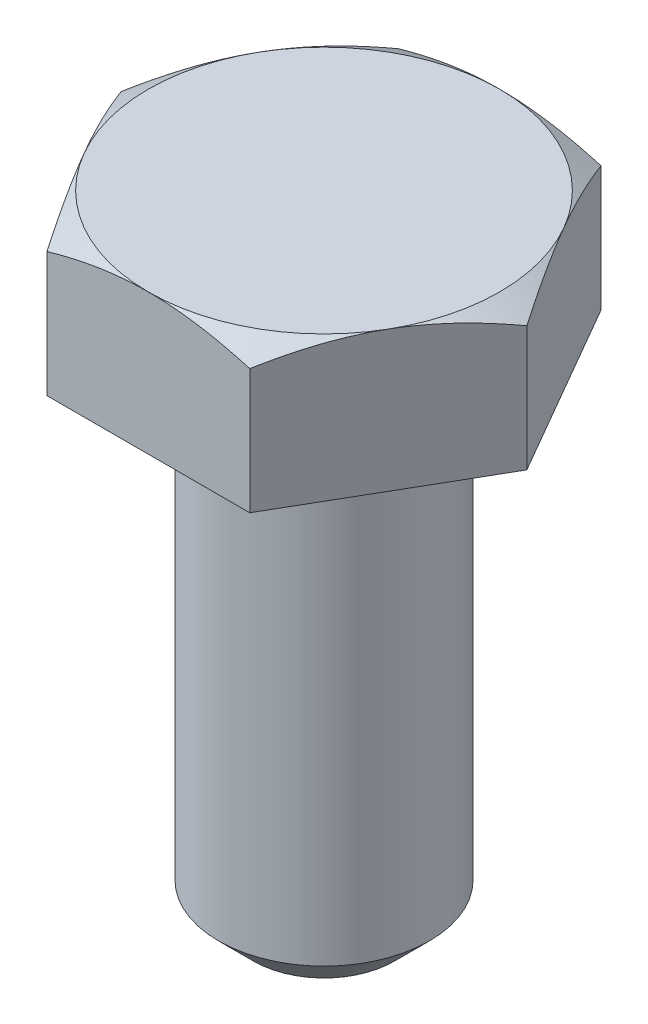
ISO-10303-21;
HEADER;
FILE_DESCRIPTION(('STEP AP214'),'2;1');
FILE_NAME('part.step','',(''),(''),'','','');
FILE_SCHEMA(('AUTOMOTIVE_DESIGN { 1 0 10303 214 1 1 1 1 }'));
ENDSEC;
DATA;
#1=APPLICATION_CONTEXT('core data for automotive mechanical design processes');
#2=APPLICATION_PROTOCOL_DEFINITION('international standard','automotive_design',2000,#1);
#3=PRODUCT_CONTEXT('',#1,'mechanical');
#4=PRODUCT('Part','Part','',(#3));
#5=PRODUCT_RELATED_PRODUCT_CATEGORY('part','',(#4));
#6=PRODUCT_DEFINITION_FORMATION('','',#4);
#7=PRODUCT_DEFINITION_CONTEXT('part definition',#1,'design');
#8=PRODUCT_DEFINITION('design','',#6,#7);
#9=PRODUCT_DEFINITION_SHAPE('','',#8);
#10=(LENGTH_UNIT() NAMED_UNIT(*) SI_UNIT(.MILLI.,.METRE.));
#11=(NAMED_UNIT(*) PLANE_ANGLE_UNIT() SI_UNIT($,.RADIAN.));
#12=(NAMED_UNIT(*) SI_UNIT($,.STERADIAN.) SOLID_ANGLE_UNIT());
#13=UNCERTAINTY_MEASURE_WITH_UNIT(LENGTH_MEASURE(1.E-05),#10,'distance_accuracy_value','');
#14=(GEOMETRIC_REPRESENTATION_CONTEXT(3) GLOBAL_UNCERTAINTY_ASSIGNED_CONTEXT((#13)) GLOBAL_UNIT_ASSIGNED_CONTEXT((#10,
#11,#12)) REPRESENTATION_CONTEXT('',''));
#15=CARTESIAN_POINT('',(0.,0.,0.));
#16=DIRECTION('',(0.,0.,1.));
#17=DIRECTION('',(1.,0.,0.));
#18=AXIS2_PLACEMENT_3D('',#15,#16,#17);
#19=CARTESIAN_POINT('',(0.,4.,0.));
#20=DIRECTION('',(0.,-1.,0.));
#21=DIRECTION('',(1.,0.,0.));
#22=AXIS2_PLACEMENT_3D('',#19,#20,#21);
#23=PLANE('',#22);
#24=CARTESIAN_POINT('',(0.,4.,0.));
#25=DIRECTION('',(0.,-1.,0.));
#26=DIRECTION('',(1.,0.,0.));
#27=AXIS2_PLACEMENT_3D('',#24,#25,#26);
#28=CIRCLE('',#27,5.);
#29=CARTESIAN_POINT('',(4.33012701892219,4.,2.50000000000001));
#30=VERTEX_POINT('',#29);
#31=CARTESIAN_POINT('',(0.,4.,4.99999999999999));
#32=VERTEX_POINT('',#31);
#33=EDGE_CURVE('E89',#30,#32,#28,.T.);
#34=ORIENTED_EDGE('',*,*,#33,.F.);
#35=CARTESIAN_POINT('',(0.,4.,0.));
#36=DIRECTION('',(0.,-1.,0.));
#37=DIRECTION('',(1.,0.,0.));
#38=AXIS2_PLACEMENT_3D('',#35,#36,#37);
#39=CIRCLE('',#38,5.);
#40=CARTESIAN_POINT('',(4.33012701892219,4.,-2.50000000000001));
#41=VERTEX_POINT('',#40);
#42=EDGE_CURVE('E87',#41,#30,#39,.T.);
#43=ORIENTED_EDGE('',*,*,#42,.F.);
#44=CARTESIAN_POINT('',(0.,4.,0.));
#45=DIRECTION('',(0.,-1.,0.));
#46=DIRECTION('',(1.,0.,0.));
#47=AXIS2_PLACEMENT_3D('',#44,#45,#46);
#48=CIRCLE('',#47,4.99999999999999);
#49=CARTESIAN_POINT('',(0.,4.,-4.99999999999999));
#50=VERTEX_POINT('',#49);
#51=EDGE_CURVE('E20',#50,#41,#48,.T.);
#52=ORIENTED_EDGE('',*,*,#51,.F.);
#53=CARTESIAN_POINT('',(0.,4.,0.));
#54=DIRECTION('',(0.,-1.,0.));
#55=DIRECTION('',(1.,0.,0.));
#56=AXIS2_PLACEMENT_3D('',#53,#54,#55);
#57=CIRCLE('',#56,5.);
#58=CARTESIAN_POINT('',(-4.33012701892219,4.,-2.50000000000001));
#59=VERTEX_POINT('',#58);
#60=EDGE_CURVE('E104',#59,#50,#57,.T.);
#61=ORIENTED_EDGE('',*,*,#60,.F.);
#62=CARTESIAN_POINT('',(0.,4.,0.));
#63=DIRECTION('',(0.,-1.,0.));
#64=DIRECTION('',(1.,0.,0.));
#65=AXIS2_PLACEMENT_3D('',#62,#63,#64);
#66=CIRCLE('',#65,5.);
#67=CARTESIAN_POINT('',(-4.33012701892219,4.,2.50000000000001));
#68=VERTEX_POINT('',#67);
#69=EDGE_CURVE('E323',#68,#59,#66,.T.);
#70=ORIENTED_EDGE('',*,*,#69,.F.);
#71=CARTESIAN_POINT('',(0.,4.,0.));
#72=DIRECTION('',(0.,-1.,0.));
#73=DIRECTION('',(1.,0.,0.));
#74=AXIS2_PLACEMENT_3D('',#71,#72,#73);
#75=CIRCLE('',#74,4.99999999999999);
#76=EDGE_CURVE('E93',#32,#68,#75,.T.);
#77=ORIENTED_EDGE('',*,*,#76,.F.);
#78=EDGE_LOOP('',(#34,#43,#52,#61,#70,#77));
#79=FACE_BOUND('',#78,.T.);
#80=ADVANCED_FACE('F16',(#79),#23,.F.);
#81=CARTESIAN_POINT('',(0.,3.55073852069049,0.));
#82=DIRECTION('',(0.,-1.,0.));
#83=DIRECTION('',(1.,0.,0.));
#84=AXIS2_PLACEMENT_3D('',#81,#82,#83);
#85=CONICAL_SURFACE('',#84,5.77814370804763,1.0471975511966);
#86=ORIENTED_EDGE('',*,*,#51,.T.);
#87=CARTESIAN_POINT('',(2.88675134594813,3.5534180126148,-4.99999999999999));
#88=CARTESIAN_POINT('',(3.00424151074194,3.62126800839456,-4.79650106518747));
#89=CARTESIAN_POINT('',(3.12267257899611,3.68343045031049,-4.59137243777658));
#90=CARTESIAN_POINT('',(3.36057867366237,3.79305279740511,-4.17930699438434));
#91=CARTESIAN_POINT('',(3.48004540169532,3.8405854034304,-3.97238455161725));
#92=CARTESIAN_POINT('',(3.66037296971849,3.89894737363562,-3.66004804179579));
#93=CARTESIAN_POINT('',(3.72070995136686,3.9162522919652,-3.55554132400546));
#94=CARTESIAN_POINT('',(3.84167277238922,3.94620746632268,-3.34602757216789));
#95=CARTESIAN_POINT('',(3.9022986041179,3.95885784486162,-3.24102055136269));
#96=CARTESIAN_POINT('',(4.02406337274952,3.97928167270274,-3.03011778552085));
#97=CARTESIAN_POINT('',(4.08520335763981,3.9870303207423,-2.92422022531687));
#98=CARTESIAN_POINT('',(4.20760356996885,3.99740020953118,-2.71221683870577));
#99=CARTESIAN_POINT('',(4.26886381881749,4.00002043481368,-2.60611097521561));
#100=CARTESIAN_POINT('',(4.33012701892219,4.,-2.50000000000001));
#101=B_SPLINE_CURVE_WITH_KNOTS('',3,(#87,#88,#89,#90,#91,#92,#93,#94,#95,#96,#97,#98,#99,#100),
.UNSPECIFIED.,.F.,.F.,(4,2,2,2,2,2,4),(0.,0.734036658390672,1.4643644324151,1.83000749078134,
2.19564092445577,2.56310985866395,2.93065154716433),.UNSPECIFIED.);
#102=CARTESIAN_POINT('',(2.88675134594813,3.5534180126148,-4.99999999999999));
#103=VERTEX_POINT('',#102);
#104=EDGE_CURVE('E99',#103,#41,#101,.T.);
#105=ORIENTED_EDGE('',*,*,#104,.F.);
#106=CARTESIAN_POINT('',(0.,4.00000000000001,-4.99999999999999));
#107=CARTESIAN_POINT('',(0.122526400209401,4.00002043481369,-4.99999999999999));
#108=CARTESIAN_POINT('',(0.245046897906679,3.99740020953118,-4.99999999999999));
#109=CARTESIAN_POINT('',(0.489847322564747,3.98703032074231,-4.99999999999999));
#110=CARTESIAN_POINT('',(0.61212729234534,3.97928167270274,-4.99999999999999));
#111=CARTESIAN_POINT('',(0.855656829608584,3.95885784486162,-4.99999999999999));
#112=CARTESIAN_POINT('',(0.976908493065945,3.94620746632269,-4.99999999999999));
#113=CARTESIAN_POINT('',(1.21883413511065,3.9162522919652,-4.99999999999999));
#114=CARTESIAN_POINT('',(1.33950809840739,3.89894737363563,-4.99999999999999));
#115=CARTESIAN_POINT('',(1.70016323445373,3.8405854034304,-4.99999999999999));
#116=CARTESIAN_POINT('',(1.93909669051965,3.79305279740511,-4.99999999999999));
#117=CARTESIAN_POINT('',(2.41490887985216,3.68343045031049,-4.99999999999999));
#118=CARTESIAN_POINT('',(2.6517710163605,3.62126800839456,-4.99999999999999));
#119=CARTESIAN_POINT('',(2.88675134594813,3.5534180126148,-4.99999999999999));
#120=B_SPLINE_CURVE_WITH_KNOTS('',3,(#106,#107,#108,#109,#110,#111,#112,#113,#114,#115,#116,
#117,#118,#119),.UNSPECIFIED.,.F.,.F.,(4,2,2,2,2,2,4),(0.,0.367541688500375,0.735010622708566,
1.10064405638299,1.46628711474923,2.19661488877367,2.93065154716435),.UNSPECIFIED.);
#121=EDGE_CURVE('E102',#50,#103,#120,.T.);
#122=ORIENTED_EDGE('',*,*,#121,.F.);
#123=EDGE_LOOP('',(#86,#105,#122));
#124=FACE_BOUND('',#123,.T.);
#125=ADVANCED_FACE('F97',(#124),#85,.T.);
#126=CARTESIAN_POINT('',(0.,3.55073852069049,0.));
#127=DIRECTION('',(0.,-1.,0.));
#128=DIRECTION('',(1.,0.,0.));
#129=AXIS2_PLACEMENT_3D('',#126,#127,#128);
#130=CONICAL_SURFACE('',#129,5.77814370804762,1.0471975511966);
#131=ORIENTED_EDGE('',*,*,#60,.T.);
#132=CARTESIAN_POINT('',(-2.88675134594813,3.5534180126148,-4.99999999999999));
#133=CARTESIAN_POINT('',(-2.65177101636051,3.62126800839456,-4.99999999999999));
#134=CARTESIAN_POINT('',(-2.41490887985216,3.68343045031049,-4.99999999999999));
#135=CARTESIAN_POINT('',(-1.93909669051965,3.79305279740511,-4.99999999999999));
#136=CARTESIAN_POINT('',(-1.70016323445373,3.8405854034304,-4.99999999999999));
#137=CARTESIAN_POINT('',(-1.33950809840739,3.89894737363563,-4.99999999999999));
#138=CARTESIAN_POINT('',(-1.21883413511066,3.9162522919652,-4.99999999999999));
#139=CARTESIAN_POINT('',(-0.976908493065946,3.94620746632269,-4.99999999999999));
#140=CARTESIAN_POINT('',(-0.855656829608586,3.95885784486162,-4.99999999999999));
#141=CARTESIAN_POINT('',(-0.612127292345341,3.97928167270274,-4.99999999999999));
#142=CARTESIAN_POINT('',(-0.489847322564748,3.98703032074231,-4.99999999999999));
#143=CARTESIAN_POINT('',(-0.245046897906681,3.99740020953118,-4.99999999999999));
#144=CARTESIAN_POINT('',(-0.122526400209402,4.00002043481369,-4.99999999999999));
#145=CARTESIAN_POINT('',(0.,4.00000000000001,-4.99999999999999));
#146=B_SPLINE_CURVE_WITH_KNOTS('',3,(#132,#133,#134,#135,#136,#137,#138,#139,#140,#141,#142,
#143,#144,#145),.UNSPECIFIED.,.F.,.F.,(4,2,2,2,2,2,4),(0.,0.734036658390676,1.46436443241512,
1.83000749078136,2.19564092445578,2.56310985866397,2.93065154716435),.UNSPECIFIED.);
#147=CARTESIAN_POINT('',(-2.88675134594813,3.5534180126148,-4.99999999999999));
#148=VERTEX_POINT('',#147);
#149=EDGE_CURVE('E113',#148,#50,#146,.T.);
#150=ORIENTED_EDGE('',*,*,#149,.F.);
#151=CARTESIAN_POINT('',(-4.33012701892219,4.,-2.50000000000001));
#152=CARTESIAN_POINT('',(-4.26886381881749,4.00002043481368,-2.60611097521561));
#153=CARTESIAN_POINT('',(-4.20760356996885,3.99740020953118,-2.71221683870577));
#154=CARTESIAN_POINT('',(-4.08520335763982,3.9870303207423,-2.92422022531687));
#155=CARTESIAN_POINT('',(-4.02406337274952,3.97928167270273,-3.03011778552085));
#156=CARTESIAN_POINT('',(-3.9022986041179,3.95885784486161,-3.24102055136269));
#157=CARTESIAN_POINT('',(-3.84167277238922,3.94620746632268,-3.34602757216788));
#158=CARTESIAN_POINT('',(-3.72070995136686,3.9162522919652,-3.55554132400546));
#159=CARTESIAN_POINT('',(-3.66037296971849,3.89894737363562,-3.66004804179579));
#160=CARTESIAN_POINT('',(-3.48004540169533,3.84058540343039,-3.97238455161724));
#161=CARTESIAN_POINT('',(-3.36057867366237,3.79305279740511,-4.17930699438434));
#162=CARTESIAN_POINT('',(-3.12267257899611,3.68343045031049,-4.59137243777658));
#163=CARTESIAN_POINT('',(-3.00424151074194,3.62126800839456,-4.79650106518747));
#164=CARTESIAN_POINT('',(-2.88675134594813,3.5534180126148,-4.99999999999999));
#165=B_SPLINE_CURVE_WITH_KNOTS('',3,(#151,#152,#153,#154,#155,#156,#157,#158,#159,#160,#161,
#162,#163,#164),.UNSPECIFIED.,.F.,.F.,(4,2,2,2,2,2,4),(0.,0.367541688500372,0.735010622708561,
1.10064405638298,1.46628711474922,2.19661488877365,2.93065154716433),.UNSPECIFIED.);
#166=EDGE_CURVE('E169',#59,#148,#165,.T.);
#167=ORIENTED_EDGE('',*,*,#166,.F.);
#168=EDGE_LOOP('',(#131,#150,#167));
#169=FACE_BOUND('',#168,.T.);
#170=ADVANCED_FACE('F137',(#169),#130,.T.);
#171=CARTESIAN_POINT('',(0.,3.55073852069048,0.));
#172=DIRECTION('',(0.,-1.,0.));
#173=DIRECTION('',(1.,0.,0.));
#174=AXIS2_PLACEMENT_3D('',#171,#172,#173);
#175=CONICAL_SURFACE('',#174,5.77814370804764,1.0471975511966);
#176=ORIENTED_EDGE('',*,*,#69,.T.);
#177=CARTESIAN_POINT('',(-5.77350269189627,3.55341801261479,0.));
#178=CARTESIAN_POINT('',(-5.65601252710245,3.62126800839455,-0.203498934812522));
#179=CARTESIAN_POINT('',(-5.53758145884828,3.68343045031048,-0.40862756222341));
#180=CARTESIAN_POINT('',(-5.29967536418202,3.7930527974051,-0.820693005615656));
#181=CARTESIAN_POINT('',(-5.18020863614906,3.84058540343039,-1.02761544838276));
#182=CARTESIAN_POINT('',(-4.99988106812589,3.89894737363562,-1.33995195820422));
#183=CARTESIAN_POINT('',(-4.93954408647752,3.91625229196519,-1.44445867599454));
#184=CARTESIAN_POINT('',(-4.81858126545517,3.94620746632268,-1.65397242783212));
#185=CARTESIAN_POINT('',(-4.75795543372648,3.95885784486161,-1.75897944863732));
#186=CARTESIAN_POINT('',(-4.63619066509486,3.97928167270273,-1.96988221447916));
#187=CARTESIAN_POINT('',(-4.57505068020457,3.9870303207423,-2.07577977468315));
#188=CARTESIAN_POINT('',(-4.45265046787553,3.99740020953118,-2.28778316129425));
#189=CARTESIAN_POINT('',(-4.39139021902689,4.00002043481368,-2.39388902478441));
#190=CARTESIAN_POINT('',(-4.33012701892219,4.,-2.50000000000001));
#191=B_SPLINE_CURVE_WITH_KNOTS('',3,(#177,#178,#179,#180,#181,#182,#183,#184,#185,#186,#187,
#188,#189,#190),.UNSPECIFIED.,.F.,.F.,(4,2,2,2,2,2,4),(0.,0.73403665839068,1.46436443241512,
1.83000749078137,2.19564092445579,2.56310985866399,2.93065154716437),.UNSPECIFIED.);
#192=CARTESIAN_POINT('',(-5.77350269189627,3.55341801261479,0.));
#193=VERTEX_POINT('',#192);
#194=EDGE_CURVE('E146',#193,#59,#191,.T.);
#195=ORIENTED_EDGE('',*,*,#194,.F.);
#196=CARTESIAN_POINT('',(-4.33012701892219,4.,2.50000000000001));
#197=CARTESIAN_POINT('',(-4.39139021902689,4.00002043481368,2.39388902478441));
#198=CARTESIAN_POINT('',(-4.45265046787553,3.99740020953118,2.28778316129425));
#199=CARTESIAN_POINT('',(-4.57505068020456,3.9870303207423,2.07577977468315));
#200=CARTESIAN_POINT('',(-4.63619066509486,3.97928167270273,1.96988221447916));
#201=CARTESIAN_POINT('',(-4.75795543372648,3.95885784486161,1.75897944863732));
#202=CARTESIAN_POINT('',(-4.81858126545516,3.94620746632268,1.65397242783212));
#203=CARTESIAN_POINT('',(-4.93954408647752,3.9162522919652,1.44445867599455));
#204=CARTESIAN_POINT('',(-4.99988106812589,3.89894737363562,1.33995195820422));
#205=CARTESIAN_POINT('',(-5.18020863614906,3.84058540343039,1.02761544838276));
#206=CARTESIAN_POINT('',(-5.29967536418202,3.7930527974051,0.820693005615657));
#207=CARTESIAN_POINT('',(-5.53758145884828,3.68343045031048,0.408627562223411));
#208=CARTESIAN_POINT('',(-5.65601252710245,3.62126800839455,0.203498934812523));
#209=CARTESIAN_POINT('',(-5.77350269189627,3.55341801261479,0.));
#210=B_SPLINE_CURVE_WITH_KNOTS('',3,(#196,#197,#198,#199,#200,#201,#202,#203,#204,#205,#206,
#207,#208,#209),.UNSPECIFIED.,.F.,.F.,(4,2,2,2,2,2,4),(0.,0.367541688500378,0.735010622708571,
1.100644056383,1.46628711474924,2.19661488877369,2.93065154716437),.UNSPECIFIED.);
#211=EDGE_CURVE('E183',#68,#193,#210,.T.);
#212=ORIENTED_EDGE('',*,*,#211,.F.);
#213=EDGE_LOOP('',(#176,#195,#212));
#214=FACE_BOUND('',#213,.T.);
#215=ADVANCED_FACE('F191',(#214),#175,.T.);
#216=CARTESIAN_POINT('',(0.,3.55073852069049,0.));
#217=DIRECTION('',(0.,-1.,0.));
#218=DIRECTION('',(1.,0.,0.));
#219=AXIS2_PLACEMENT_3D('',#216,#217,#218);
#220=CONICAL_SURFACE('',#219,5.77814370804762,1.0471975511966);
#221=ORIENTED_EDGE('',*,*,#76,.T.);
#222=CARTESIAN_POINT('',(-2.88675134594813,3.5534180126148,4.99999999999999));
#223=CARTESIAN_POINT('',(-3.00424151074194,3.62126800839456,4.79650106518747));
#224=CARTESIAN_POINT('',(-3.12267257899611,3.68343045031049,4.59137243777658));
#225=CARTESIAN_POINT('',(-3.36057867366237,3.7930527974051,4.17930699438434));
#226=CARTESIAN_POINT('',(-3.48004540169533,3.84058540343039,3.97238455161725));
#227=CARTESIAN_POINT('',(-3.66037296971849,3.89894737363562,3.66004804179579));
#228=CARTESIAN_POINT('',(-3.72070995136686,3.9162522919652,3.55554132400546));
#229=CARTESIAN_POINT('',(-3.84167277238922,3.94620746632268,3.34602757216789));
#230=CARTESIAN_POINT('',(-3.9022986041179,3.95885784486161,3.24102055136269));
#231=CARTESIAN_POINT('',(-4.02406337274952,3.97928167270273,3.03011778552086));
#232=CARTESIAN_POINT('',(-4.08520335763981,3.9870303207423,2.92422022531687));
#233=CARTESIAN_POINT('',(-4.20760356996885,3.99740020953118,2.71221683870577));
#234=CARTESIAN_POINT('',(-4.26886381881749,4.00002043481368,2.60611097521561));
#235=CARTESIAN_POINT('',(-4.33012701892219,4.,2.50000000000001));
#236=B_SPLINE_CURVE_WITH_KNOTS('',3,(#222,#223,#224,#225,#226,#227,#228,#229,#230,#231,#232,
#233,#234,#235),.UNSPECIFIED.,.F.,.F.,(4,2,2,2,2,2,4),(0.,0.734036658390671,1.4643644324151,
1.83000749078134,2.19564092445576,2.56310985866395,2.93065154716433),.UNSPECIFIED.);
#237=CARTESIAN_POINT('',(-2.88675134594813,3.5534180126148,4.99999999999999));
#238=VERTEX_POINT('',#237);
#239=EDGE_CURVE('E176',#238,#68,#236,.T.);
#240=ORIENTED_EDGE('',*,*,#239,.F.);
#241=CARTESIAN_POINT('',(0.,4.00000000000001,4.99999999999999));
#242=CARTESIAN_POINT('',(-0.122526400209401,4.00002043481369,4.99999999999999));
#243=CARTESIAN_POINT('',(-0.24504689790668,3.99740020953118,4.99999999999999));
#244=CARTESIAN_POINT('',(-0.489847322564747,3.98703032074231,4.99999999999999));
#245=CARTESIAN_POINT('',(-0.61212729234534,3.97928167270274,4.99999999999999));
#246=CARTESIAN_POINT('',(-0.855656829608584,3.95885784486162,4.99999999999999));
#247=CARTESIAN_POINT('',(-0.976908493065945,3.94620746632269,4.99999999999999));
#248=CARTESIAN_POINT('',(-1.21883413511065,3.9162522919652,4.99999999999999));
#249=CARTESIAN_POINT('',(-1.33950809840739,3.89894737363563,4.99999999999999));
#250=CARTESIAN_POINT('',(-1.70016323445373,3.8405854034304,4.99999999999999));
#251=CARTESIAN_POINT('',(-1.93909669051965,3.79305279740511,4.99999999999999));
#252=CARTESIAN_POINT('',(-2.41490887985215,3.68343045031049,4.99999999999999));
#253=CARTESIAN_POINT('',(-2.6517710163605,3.62126800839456,4.99999999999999));
#254=CARTESIAN_POINT('',(-2.88675134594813,3.5534180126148,4.99999999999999));
#255=B_SPLINE_CURVE_WITH_KNOTS('',3,(#241,#242,#243,#244,#245,#246,#247,#248,#249,#250,#251,
#252,#253,#254),.UNSPECIFIED.,.F.,.F.,(4,2,2,2,2,2,4),(0.,0.367541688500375,0.735010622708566,
1.10064405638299,1.46628711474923,2.19661488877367,2.93065154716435),.UNSPECIFIED.);
#256=EDGE_CURVE('E198',#32,#238,#255,.T.);
#257=ORIENTED_EDGE('',*,*,#256,.F.);
#258=EDGE_LOOP('',(#221,#240,#257));
#259=FACE_BOUND('',#258,.T.);
#260=ADVANCED_FACE('F188',(#259),#220,.T.);
#261=CARTESIAN_POINT('',(0.,3.55073852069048,0.));
#262=DIRECTION('',(0.,-1.,0.));
#263=DIRECTION('',(1.,0.,0.));
#264=AXIS2_PLACEMENT_3D('',#261,#262,#263);
#265=CONICAL_SURFACE('',#264,5.77814370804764,1.0471975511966);
#266=ORIENTED_EDGE('',*,*,#42,.T.);
#267=CARTESIAN_POINT('',(5.77350269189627,3.55341801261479,0.));
#268=CARTESIAN_POINT('',(5.65601252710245,3.62126800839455,0.203498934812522));
#269=CARTESIAN_POINT('',(5.53758145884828,3.68343045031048,0.40862756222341));
#270=CARTESIAN_POINT('',(5.29967536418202,3.7930527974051,0.820693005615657));
#271=CARTESIAN_POINT('',(5.18020863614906,3.84058540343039,1.02761544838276));
#272=CARTESIAN_POINT('',(4.99988106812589,3.89894737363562,1.33995195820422));
#273=CARTESIAN_POINT('',(4.93954408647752,3.9162522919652,1.44445867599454));
#274=CARTESIAN_POINT('',(4.81858126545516,3.94620746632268,1.65397242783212));
#275=CARTESIAN_POINT('',(4.75795543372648,3.95885784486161,1.75897944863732));
#276=CARTESIAN_POINT('',(4.63619066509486,3.97928167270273,1.96988221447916));
#277=CARTESIAN_POINT('',(4.57505068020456,3.9870303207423,2.07577977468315));
#278=CARTESIAN_POINT('',(4.45265046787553,3.99740020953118,2.28778316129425));
#279=CARTESIAN_POINT('',(4.39139021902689,4.00002043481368,2.39388902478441));
#280=CARTESIAN_POINT('',(4.33012701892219,4.,2.50000000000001));
#281=B_SPLINE_CURVE_WITH_KNOTS('',3,(#267,#268,#269,#270,#271,#272,#273,#274,#275,#276,#277,
#278,#279,#280),.UNSPECIFIED.,.F.,.F.,(4,2,2,2,2,2,4),(0.,0.734036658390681,1.46436443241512,
1.83000749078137,2.19564092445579,2.56310985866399,2.93065154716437),.UNSPECIFIED.);
#282=CARTESIAN_POINT('',(5.77350269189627,3.55341801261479,0.));
#283=VERTEX_POINT('',#282);
#284=EDGE_CURVE('E109',#283,#30,#281,.T.);
#285=ORIENTED_EDGE('',*,*,#284,.F.);
#286=CARTESIAN_POINT('',(4.33012701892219,4.,-2.50000000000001));
#287=CARTESIAN_POINT('',(4.39139021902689,4.00002043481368,-2.39388902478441));
#288=CARTESIAN_POINT('',(4.45265046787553,3.99740020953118,-2.28778316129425));
#289=CARTESIAN_POINT('',(4.57505068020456,3.9870303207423,-2.07577977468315));
#290=CARTESIAN_POINT('',(4.63619066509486,3.97928167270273,-1.96988221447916));
#291=CARTESIAN_POINT('',(4.75795543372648,3.95885784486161,-1.75897944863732));
#292=CARTESIAN_POINT('',(4.81858126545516,3.94620746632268,-1.65397242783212));
#293=CARTESIAN_POINT('',(4.93954408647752,3.9162522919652,-1.44445867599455));
#294=CARTESIAN_POINT('',(4.99988106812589,3.89894737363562,-1.33995195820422));
#295=CARTESIAN_POINT('',(5.18020863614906,3.84058540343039,-1.02761544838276));
#296=CARTESIAN_POINT('',(5.29967536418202,3.7930527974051,-0.820693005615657));
#297=CARTESIAN_POINT('',(5.53758145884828,3.68343045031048,-0.408627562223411));
#298=CARTESIAN_POINT('',(5.65601252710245,3.62126800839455,-0.203498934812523));
#299=CARTESIAN_POINT('',(5.77350269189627,3.55341801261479,0.));
#300=B_SPLINE_CURVE_WITH_KNOTS('',3,(#286,#287,#288,#289,#290,#291,#292,#293,#294,#295,#296,
#297,#298,#299),.UNSPECIFIED.,.F.,.F.,(4,2,2,2,2,2,4),(0.,0.367541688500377,0.735010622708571,
1.100644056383,1.46628711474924,2.19661488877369,2.93065154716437),.UNSPECIFIED.);
#301=EDGE_CURVE('E106',#41,#283,#300,.T.);
#302=ORIENTED_EDGE('',*,*,#301,.F.);
#303=EDGE_LOOP('',(#266,#285,#302));
#304=FACE_BOUND('',#303,.T.);
#305=ADVANCED_FACE('F107',(#304),#265,.T.);
#306=CARTESIAN_POINT('',(0.,3.55073852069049,0.));
#307=DIRECTION('',(0.,-1.,0.));
#308=DIRECTION('',(1.,0.,0.));
#309=AXIS2_PLACEMENT_3D('',#306,#307,#308);
#310=CONICAL_SURFACE('',#309,5.77814370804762,1.0471975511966);
#311=ORIENTED_EDGE('',*,*,#33,.T.);
#312=CARTESIAN_POINT('',(2.88675134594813,3.5534180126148,4.99999999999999));
#313=CARTESIAN_POINT('',(2.6517710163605,3.62126800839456,4.99999999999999));
#314=CARTESIAN_POINT('',(2.41490887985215,3.68343045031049,4.99999999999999));
#315=CARTESIAN_POINT('',(1.93909669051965,3.79305279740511,4.99999999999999));
#316=CARTESIAN_POINT('',(1.70016323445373,3.8405854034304,4.99999999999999));
#317=CARTESIAN_POINT('',(1.33950809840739,3.89894737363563,4.99999999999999));
#318=CARTESIAN_POINT('',(1.21883413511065,3.9162522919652,4.99999999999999));
#319=CARTESIAN_POINT('',(0.976908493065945,3.94620746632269,4.99999999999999));
#320=CARTESIAN_POINT('',(0.855656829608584,3.95885784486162,4.99999999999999));
#321=CARTESIAN_POINT('',(0.61212729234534,3.97928167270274,4.99999999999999));
#322=CARTESIAN_POINT('',(0.489847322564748,3.98703032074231,4.99999999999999));
#323=CARTESIAN_POINT('',(0.24504689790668,3.99740020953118,4.99999999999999));
#324=CARTESIAN_POINT('',(0.122526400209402,4.00002043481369,4.99999999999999));
#325=CARTESIAN_POINT('',(0.,4.00000000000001,4.99999999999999));
#326=B_SPLINE_CURVE_WITH_KNOTS('',3,(#312,#313,#314,#315,#316,#317,#318,#319,#320,#321,#322,
#323,#324,#325),.UNSPECIFIED.,.F.,.F.,(4,2,2,2,2,2,4),(0.,0.734036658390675,1.46436443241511,
1.83000749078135,2.19564092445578,2.56310985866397,2.93065154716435),.UNSPECIFIED.);
#327=CARTESIAN_POINT('',(2.88675134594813,3.5534180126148,4.99999999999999));
#328=VERTEX_POINT('',#327);
#329=EDGE_CURVE('E205',#328,#32,#326,.T.);
#330=ORIENTED_EDGE('',*,*,#329,.F.);
#331=CARTESIAN_POINT('',(4.33012701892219,4.,2.50000000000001));
#332=CARTESIAN_POINT('',(4.26886381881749,4.00002043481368,2.60611097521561));
#333=CARTESIAN_POINT('',(4.20760356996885,3.99740020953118,2.71221683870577));
#334=CARTESIAN_POINT('',(4.08520335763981,3.9870303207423,2.92422022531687));
#335=CARTESIAN_POINT('',(4.02406337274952,3.97928167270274,3.03011778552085));
#336=CARTESIAN_POINT('',(3.90229860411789,3.95885784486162,3.24102055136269));
#337=CARTESIAN_POINT('',(3.84167277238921,3.94620746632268,3.34602757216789));
#338=CARTESIAN_POINT('',(3.72070995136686,3.9162522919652,3.55554132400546));
#339=CARTESIAN_POINT('',(3.66037296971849,3.89894737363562,3.66004804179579));
#340=CARTESIAN_POINT('',(3.48004540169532,3.8405854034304,3.97238455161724));
#341=CARTESIAN_POINT('',(3.36057867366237,3.79305279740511,4.17930699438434));
#342=CARTESIAN_POINT('',(3.12267257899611,3.68343045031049,4.59137243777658));
#343=CARTESIAN_POINT('',(3.00424151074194,3.62126800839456,4.79650106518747));
#344=CARTESIAN_POINT('',(2.88675134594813,3.5534180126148,4.99999999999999));
#345=B_SPLINE_CURVE_WITH_KNOTS('',3,(#331,#332,#333,#334,#335,#336,#337,#338,#339,#340,#341,
#342,#343,#344),.UNSPECIFIED.,.F.,.F.,(4,2,2,2,2,2,4),(0.,0.367541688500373,0.735010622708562,
1.10064405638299,1.46628711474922,2.19661488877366,2.93065154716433),.UNSPECIFIED.);
#346=EDGE_CURVE('E225',#30,#328,#345,.T.);
#347=ORIENTED_EDGE('',*,*,#346,.F.);
#348=EDGE_LOOP('',(#311,#330,#347));
#349=FACE_BOUND('',#348,.T.);
#350=ADVANCED_FACE('F233',(#349),#310,.T.);
#351=CARTESIAN_POINT('',(0.,-14.,0.));
#352=DIRECTION('',(0.,1.,0.));
#353=DIRECTION('',(0.,0.,1.));
#354=AXIS2_PLACEMENT_3D('',#351,#352,#353);
#355=PLANE('',#354);
#356=CARTESIAN_POINT('',(0.,-14.00000000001,0.));
#357=DIRECTION('',(0.,1.,0.));
#358=DIRECTION('',(0.,0.,1.));
#359=AXIS2_PLACEMENT_3D('',#356,#357,#358);
#360=CIRCLE('',#359,1.99999999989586);
#361=CARTESIAN_POINT('',(0.,-14.00000000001,1.99999999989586));
#362=VERTEX_POINT('',#361);
#363=EDGE_CURVE('E232',#362,#362,#360,.T.);
#364=ORIENTED_EDGE('',*,*,#363,.F.);
#365=EDGE_LOOP('',(#364));
#366=FACE_BOUND('',#365,.T.);
#367=ADVANCED_FACE('F236',(#366),#355,.F.);
#368=CARTESIAN_POINT('',(2.88675134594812,24.2,-4.99999999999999));
#369=DIRECTION('',(0.866025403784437,0.,-0.500000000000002));
#370=DIRECTION('',(-0.500000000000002,0.,-0.866025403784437));
#371=AXIS2_PLACEMENT_3D('',#368,#369,#370);
#372=PLANE('',#371);
#373=DIRECTION('',(-0.500000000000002,0.,-0.866025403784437));
#374=VECTOR('',#373,1.);
#375=CARTESIAN_POINT('',(5.77350269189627,0.,0.));
#376=LINE('',#375,#374);
#377=CARTESIAN_POINT('',(5.77350269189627,0.,0.));
#378=VERTEX_POINT('',#377);
#379=CARTESIAN_POINT('',(2.88675134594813,0.,-4.99999999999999));
#380=VERTEX_POINT('',#379);
#381=EDGE_CURVE('E268',#378,#380,#376,.T.);
#382=ORIENTED_EDGE('',*,*,#381,.T.);
#383=DIRECTION('',(0.,1.,0.));
#384=VECTOR('',#383,1.);
#385=CARTESIAN_POINT('',(2.88675134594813,24.2,-4.99999999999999));
#386=LINE('',#385,#384);
#387=EDGE_CURVE('E117',#103,#380,#386,.F.);
#388=ORIENTED_EDGE('',*,*,#387,.F.);
#389=ORIENTED_EDGE('',*,*,#104,.T.);
#390=ORIENTED_EDGE('',*,*,#301,.T.);
#391=DIRECTION('',(0.,1.,0.));
#392=VECTOR('',#391,1.);
#393=CARTESIAN_POINT('',(5.77350269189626,24.2,0.));
#394=LINE('',#393,#392);
#395=EDGE_CURVE('E312',#378,#283,#394,.T.);
#396=ORIENTED_EDGE('',*,*,#395,.F.);
#397=EDGE_LOOP('',(#382,#388,#389,#390,#396));
#398=FACE_BOUND('',#397,.T.);
#399=ADVANCED_FACE('F115',(#398),#372,.T.);
#400=CARTESIAN_POINT('',(-2.88675134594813,24.2,-4.99999999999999));
#401=DIRECTION('',(0.,0.,-1.));
#402=DIRECTION('',(-1.,0.,0.));
#403=AXIS2_PLACEMENT_3D('',#400,#401,#402);
#404=PLANE('',#403);
#405=DIRECTION('',(-1.,0.,0.));
#406=VECTOR('',#405,1.);
#407=CARTESIAN_POINT('',(0.,0.,-4.99999999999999));
#408=LINE('',#407,#406);
#409=CARTESIAN_POINT('',(-2.88675134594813,0.,-4.99999999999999));
#410=VERTEX_POINT('',#409);
#411=EDGE_CURVE('E270',#380,#410,#408,.T.);
#412=ORIENTED_EDGE('',*,*,#411,.T.);
#413=DIRECTION('',(0.,1.,0.));
#414=VECTOR('',#413,1.);
#415=CARTESIAN_POINT('',(-2.88675134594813,24.2,-4.99999999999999));
#416=LINE('',#415,#414);
#417=EDGE_CURVE('E175',#148,#410,#416,.F.);
#418=ORIENTED_EDGE('',*,*,#417,.F.);
#419=ORIENTED_EDGE('',*,*,#149,.T.);
#420=ORIENTED_EDGE('',*,*,#121,.T.);
#421=ORIENTED_EDGE('',*,*,#387,.T.);
#422=EDGE_LOOP('',(#412,#418,#419,#420,#421));
#423=FACE_BOUND('',#422,.T.);
#424=ADVANCED_FACE('F155',(#423),#404,.T.);
#425=CARTESIAN_POINT('',(-2.88675134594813,24.2,-4.99999999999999));
#426=DIRECTION('',(-0.866025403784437,0.,-0.500000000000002));
#427=DIRECTION('',(-0.500000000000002,0.,0.866025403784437));
#428=AXIS2_PLACEMENT_3D('',#425,#426,#427);
#429=PLANE('',#428);
#430=DIRECTION('',(-0.500000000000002,0.,0.866025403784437));
#431=VECTOR('',#430,1.);
#432=CARTESIAN_POINT('',(-2.88675134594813,0.,-4.99999999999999));
#433=LINE('',#432,#431);
#434=CARTESIAN_POINT('',(-5.77350269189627,0.,0.));
#435=VERTEX_POINT('',#434);
#436=EDGE_CURVE('E278',#410,#435,#433,.T.);
#437=ORIENTED_EDGE('',*,*,#436,.T.);
#438=DIRECTION('',(0.,1.,0.));
#439=VECTOR('',#438,1.);
#440=CARTESIAN_POINT('',(-5.77350269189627,24.2,0.));
#441=LINE('',#440,#439);
#442=EDGE_CURVE('E302',#193,#435,#441,.F.);
#443=ORIENTED_EDGE('',*,*,#442,.F.);
#444=ORIENTED_EDGE('',*,*,#194,.T.);
#445=ORIENTED_EDGE('',*,*,#166,.T.);
#446=ORIENTED_EDGE('',*,*,#417,.T.);
#447=EDGE_LOOP('',(#437,#443,#444,#445,#446));
#448=FACE_BOUND('',#447,.T.);
#449=ADVANCED_FACE('F158',(#448),#429,.T.);
#450=CARTESIAN_POINT('',(-2.88675134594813,24.2,4.99999999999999));
#451=DIRECTION('',(-0.866025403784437,0.,0.500000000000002));
#452=DIRECTION('',(0.500000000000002,0.,0.866025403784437));
#453=AXIS2_PLACEMENT_3D('',#450,#451,#452);
#454=PLANE('',#453);
#455=DIRECTION('',(0.500000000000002,0.,0.866025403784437));
#456=VECTOR('',#455,1.);
#457=CARTESIAN_POINT('',(-5.77350269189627,0.,0.));
#458=LINE('',#457,#456);
#459=CARTESIAN_POINT('',(-2.88675134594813,0.,4.99999999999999));
#460=VERTEX_POINT('',#459);
#461=EDGE_CURVE('E274',#435,#460,#458,.T.);
#462=ORIENTED_EDGE('',*,*,#461,.T.);
#463=DIRECTION('',(0.,1.,0.));
#464=VECTOR('',#463,1.);
#465=CARTESIAN_POINT('',(-2.88675134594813,24.2,4.99999999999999));
#466=LINE('',#465,#464);
#467=EDGE_CURVE('E204',#238,#460,#466,.F.);
#468=ORIENTED_EDGE('',*,*,#467,.F.);
#469=ORIENTED_EDGE('',*,*,#239,.T.);
#470=ORIENTED_EDGE('',*,*,#211,.T.);
#471=ORIENTED_EDGE('',*,*,#442,.T.);
#472=EDGE_LOOP('',(#462,#468,#469,#470,#471));
#473=FACE_BOUND('',#472,.T.);
#474=ADVANCED_FACE('F164',(#473),#454,.T.);
#475=CARTESIAN_POINT('',(-2.88675134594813,24.2,4.99999999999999));
#476=DIRECTION('',(0.,0.,1.));
#477=DIRECTION('',(1.,0.,0.));
#478=AXIS2_PLACEMENT_3D('',#475,#476,#477);
#479=PLANE('',#478);
#480=DIRECTION('',(-1.,0.,0.));
#481=VECTOR('',#480,1.);
#482=CARTESIAN_POINT('',(0.,0.,4.99999999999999));
#483=LINE('',#482,#481);
#484=CARTESIAN_POINT('',(2.88675134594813,0.,4.99999999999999));
#485=VERTEX_POINT('',#484);
#486=EDGE_CURVE('E35',#460,#485,#483,.F.);
#487=ORIENTED_EDGE('',*,*,#486,.T.);
#488=DIRECTION('',(0.,1.,0.));
#489=VECTOR('',#488,1.);
#490=CARTESIAN_POINT('',(2.88675134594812,24.2,4.99999999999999));
#491=LINE('',#490,#489);
#492=EDGE_CURVE('E231',#328,#485,#491,.F.);
#493=ORIENTED_EDGE('',*,*,#492,.F.);
#494=ORIENTED_EDGE('',*,*,#329,.T.);
#495=ORIENTED_EDGE('',*,*,#256,.T.);
#496=ORIENTED_EDGE('',*,*,#467,.T.);
#497=EDGE_LOOP('',(#487,#493,#494,#495,#496));
#498=FACE_BOUND('',#497,.T.);
#499=ADVANCED_FACE('F214',(#498),#479,.T.);
#500=CARTESIAN_POINT('',(2.88675134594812,24.2,4.99999999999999));
#501=DIRECTION('',(0.866025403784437,0.,0.500000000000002));
#502=DIRECTION('',(0.500000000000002,0.,-0.866025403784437));
#503=AXIS2_PLACEMENT_3D('',#500,#501,#502);
#504=PLANE('',#503);
#505=DIRECTION('',(0.500000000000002,0.,-0.866025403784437));
#506=VECTOR('',#505,1.);
#507=CARTESIAN_POINT('',(2.88675134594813,0.,4.99999999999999));
#508=LINE('',#507,#506);
#509=EDGE_CURVE('E258',#485,#378,#508,.T.);
#510=ORIENTED_EDGE('',*,*,#509,.T.);
#511=ORIENTED_EDGE('',*,*,#395,.T.);
#512=ORIENTED_EDGE('',*,*,#284,.T.);
#513=ORIENTED_EDGE('',*,*,#346,.T.);
#514=ORIENTED_EDGE('',*,*,#492,.T.);
#515=EDGE_LOOP('',(#510,#511,#512,#513,#514));
#516=FACE_BOUND('',#515,.T.);
#517=ADVANCED_FACE('F217',(#516),#504,.T.);
#518=CARTESIAN_POINT('',(0.,-12.9999999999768,0.));
#519=DIRECTION('',(0.,1.,0.));
#520=DIRECTION('',(0.,0.,1.));
#521=AXIS2_PLACEMENT_3D('',#518,#519,#520);
#522=CONICAL_SURFACE('',#521,2.99999999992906,0.785398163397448);
#523=CARTESIAN_POINT('',(0.,-13.,0.));
#524=DIRECTION('',(0.,1.,0.));
#525=DIRECTION('',(0.,0.,1.));
#526=AXIS2_PLACEMENT_3D('',#523,#524,#525);
#527=CIRCLE('',#526,3.);
#528=CARTESIAN_POINT('',(0.,-13.,3.));
#529=VERTEX_POINT('',#528);
#530=EDGE_CURVE('E26',#529,#529,#527,.T.);
#531=ORIENTED_EDGE('',*,*,#530,.F.);
#532=EDGE_LOOP('',(#531));
#533=FACE_BOUND('',#532,.T.);
#534=ORIENTED_EDGE('',*,*,#363,.T.);
#535=EDGE_LOOP('',(#534));
#536=FACE_BOUND('',#535,.T.);
#537=ADVANCED_FACE('F222',(#533,#536),#522,.T.);
#538=CARTESIAN_POINT('',(0.,0.,0.));
#539=DIRECTION('',(0.,1.,0.));
#540=DIRECTION('',(-1.,0.,0.));
#541=AXIS2_PLACEMENT_3D('',#538,#539,#540);
#542=PLANE('',#541);
#543=ORIENTED_EDGE('',*,*,#486,.F.);
#544=ORIENTED_EDGE('',*,*,#461,.F.);
#545=ORIENTED_EDGE('',*,*,#436,.F.);
#546=ORIENTED_EDGE('',*,*,#411,.F.);
#547=ORIENTED_EDGE('',*,*,#381,.F.);
#548=ORIENTED_EDGE('',*,*,#509,.F.);
#549=EDGE_LOOP('',(#543,#544,#545,#546,#547,#548));
#550=FACE_BOUND('',#549,.T.);
#551=CARTESIAN_POINT('',(0.,0.,0.));
#552=DIRECTION('',(0.,1.,0.));
#553=DIRECTION('',(0.,0.,1.));
#554=AXIS2_PLACEMENT_3D('',#551,#552,#553);
#555=CIRCLE('',#554,3.);
#556=CARTESIAN_POINT('',(0.,0.,3.));
#557=VERTEX_POINT('',#556);
#558=EDGE_CURVE('E10',#557,#557,#555,.F.);
#559=ORIENTED_EDGE('',*,*,#558,.F.);
#560=EDGE_LOOP('',(#559));
#561=FACE_BOUND('',#560,.T.);
#562=ADVANCED_FACE('F247',(#550,#561),#542,.F.);
#563=CARTESIAN_POINT('',(0.,-14.,0.));
#564=DIRECTION('',(0.,1.,0.));
#565=DIRECTION('',(0.,0.,1.));
#566=AXIS2_PLACEMENT_3D('',#563,#564,#565);
#567=CYLINDRICAL_SURFACE('',#566,3.);
#568=ORIENTED_EDGE('',*,*,#558,.T.);
#569=EDGE_LOOP('',(#568));
#570=FACE_BOUND('',#569,.T.);
#571=ORIENTED_EDGE('',*,*,#530,.T.);
#572=EDGE_LOOP('',(#571));
#573=FACE_BOUND('',#572,.T.);
#574=ADVANCED_FACE('F18',(#570,#573),#567,.T.);
#575=CLOSED_SHELL('',(#80,#125,#170,#215,#260,#305,#350,#367,#399,#424,#449,#474,#499,#517,#537,
#562,#574));
#576=MANIFOLD_SOLID_BREP('B1',#575);
#577=ADVANCED_BREP_SHAPE_REPRESENTATION('',(#18,#576),#14);
#578=SHAPE_DEFINITION_REPRESENTATION(#9,#577);
ENDSEC;
END-ISO-10303-21;
